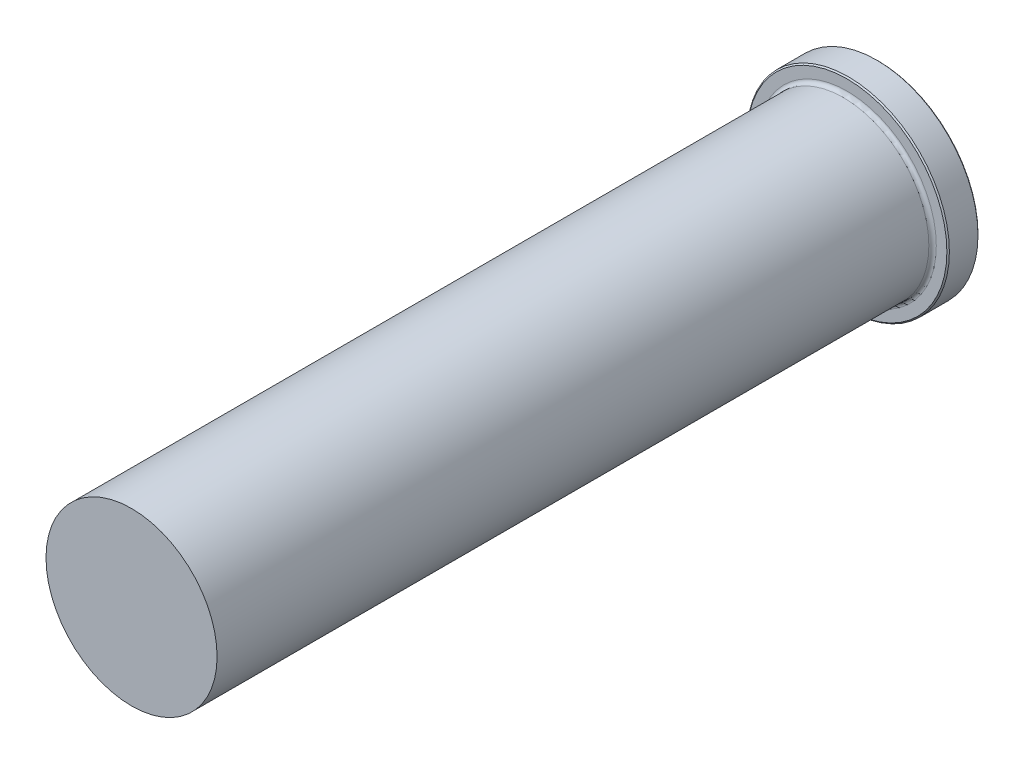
from build123d import *

# Parameters (mm, degrees)
FILLET1_R     = 0.762
CHAMFER1_SIZE = 0.254


with BuildPart() as part:
    # Sketch1 → Revolve1 (revolve)
    with BuildSketch(Plane(origin=(0, 0, 0), x_dir=(0, 0, -1), z_dir=(1, 0, 0)), mode=Mode.PRIVATE) as revolve1_sk:
        Polygon((0, 0), (0, 20.6375), (-6.35, 20.6375), (-6.35, 17.4625), (-152.4, 17.4625), (-152.4, 0), align=None)
    revolve(revolve1_sk.sketch.rotate(Axis((0, 0, 0), (0, 0, 1)), 90), axis=Axis((0, 0, 0), (0, 0, 1)))

    # Fillet1
    fillet1_edges = [part.edges().sort_by_distance(p)[0] for p in [
        (17.4625, 0, 6.35),
    ]]
    fillet(fillet1_edges, radius=FILLET1_R)

    # Chamfer1
    chamfer1_edges = [part.edges().sort_by_distance(p)[0] for p in [
        (20.6375, 0, 6.35),
        (20.6375, 0, 0),
    ]]
    chamfer(chamfer1_edges, length=CHAMFER1_SIZE)


solid = part.part
